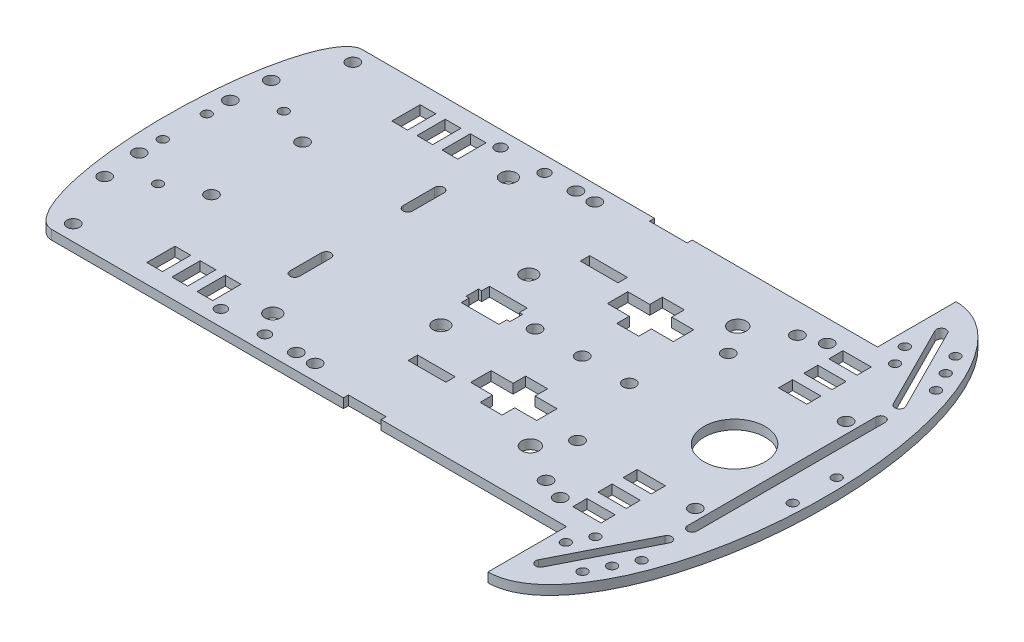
from build123d import *

# Parameters (mm, degrees)
SKETCH1_W           = 210
SKETCH1_H           = 149
BOSS_EXTRUDE1_DEPTH = 3
SKETCH2_W           = 177
SKETCH2_H           = 25
CUT_EXTRUDE1_DEPTH  = 3
SKETCH3_W           = 12
SKETCH3_H           = 3
SKETCH3_W_2         = 7
SKETCH3_H_2         = 6.5
SKETCH3_H_3         = 4
SKETCH3_R           = 2
SKETCH3_R_2         = 2.75
SKETCH3_W_3         = 9
SKETCH3_H_4         = 4.5
SKETCH3_H_5         = 1.6
SKETCH3_H_6         = 14.5
SKETCH3_W_4         = 21
CUT_EXTRUDE2_DEPTH  = 3
SKETCH4_R           = 2
SKETCH4_R_2         = 1.75
SKETCH4_R_3         = 2.5
CUT_EXTRUDE3_DEPTH  = 3
SKETCH5_W           = 5
SKETCH5_H           = 9
CUT_EXTRUDE4_DEPTH  = 3
SKETCH7_R           = 9.75
SKETCH7_R_2         = 2
SKETCH7_R_3         = 2.5
SKETCH7_W           = 12
SKETCH7_H           = 9
SKETCH7_W_2         = 14
SKETCH7_H_2         = 4
CUT_EXTRUDE5_DEPTH  = 3
SKETCH6_R           = 2
SKETCH6_R_2         = 1.5
CUT_EXTRUDE6_DEPTH  = 3
CUT_EXTRUDE7_DEPTH  = 3
SKETCH9_R           = 1.5
SKETCH9_R_2         = 2
CUT_EXTRUDE8_DEPTH  = 3
CUT_EXTRUDE9_DEPTH  = 3
CUT_EXTRUDE10_DEPTH = 3


with BuildPart() as part:
    # Sketch1 → Boss-Extrude1 (new body)
    with BuildSketch(Plane(origin=(0, 0, 0), x_dir=(1, 0, 0), z_dir=(0, 1, 0))):
        with Locations((105, 74.5)):
            Rectangle(SKETCH1_W, SKETCH1_H)
    extrude(amount=BOSS_EXTRUDE1_DEPTH)

    # Sketch2 → Cut-Extrude1 (cut)
    with BuildSketch(Plane(origin=(0, 3, 0), x_dir=(1, 0, 0), z_dir=(0, 1, 0))):
        with Locations((88.5, 136.5)):
            Rectangle(SKETCH2_W, SKETCH2_H)
        with Locations((88.5, 12.5)):
            Rectangle(SKETCH2_W, SKETCH2_H)
    extrude(amount=-CUT_EXTRUDE1_DEPTH, mode=Mode.SUBTRACT)

    # Sketch3 → Cut-Extrude2 (cut)
    with BuildSketch(Plane(origin=(0, 3, 0), x_dir=(1, 0, 0), z_dir=(0, 1, 0))):
        with Locations((112, 101.9)):
            Rectangle(SKETCH3_W, SKETCH3_H)
        with Locations((125.5, 96.25)):
            Rectangle(SKETCH3_W_2, SKETCH3_H_2)
        with Locations((132.5, 96.25)):
            Rectangle(SKETCH3_W_2, SKETCH3_H_2)
        with Locations((139.5, 96.25)):
            Rectangle(SKETCH3_W_2, SKETCH3_H_2)
        with Locations((132.5, 91)):
            Rectangle(SKETCH3_W_2, SKETCH3_H_3)
        with Locations((132.5, 101.5)):
            Rectangle(SKETCH3_W_2, SKETCH3_H_3)
        with Locations(Location((155, 98.5, 0), (0, 0, 270))):
            Circle(SKETCH3_R)
        with Locations(Location((149, 107.5, 0), (0, 0, 270))):
            Circle(SKETCH3_R_2)
        with Locations(Location((161, 114.5, 0), (0, 0, 270))):
            Circle(SKETCH3_R)
        with Locations(Location((168, 117, 0), (0, 0, 270))):
            Circle(SKETCH3_R)
        with Locations((177, 115.25)):
            Rectangle(SKETCH3_W_3, SKETCH3_H_4)
        with Locations((177, 107.25)):
            Rectangle(SKETCH3_W_3, SKETCH3_H_4)
        with Locations((177, 99.25)):
            Rectangle(SKETCH3_W_3, SKETCH3_H_4)
        with Locations((112, 47.1)):
            Rectangle(SKETCH3_W, SKETCH3_H)
        with Locations((112, 123.2)):
            Rectangle(SKETCH3_W, SKETCH3_H_5)
        with Locations((112, 25.8)):
            Rectangle(SKETCH3_W, SKETCH3_H_5)
        with Locations((132.5, 52.75)):
            Rectangle(SKETCH3_W_2, SKETCH3_H_6)
        with Locations((132.5, 52.75)):
            Rectangle(SKETCH3_W_4, SKETCH3_H_2)
        with Locations(Location((149, 41.5, 0), (0, 0, 90))):
            Circle(SKETCH3_R_2)
        with Locations(Location((155, 50.5, 0), (0, 0, 90))):
            Circle(SKETCH3_R)
        with Locations(Location((161, 34.5, 0), (0, 0, 90))):
            Circle(SKETCH3_R)
        with Locations(Location((168, 32, 0), (0, 0, 90))):
            Circle(SKETCH3_R)
        with Locations((177, 49.75)):
            Rectangle(SKETCH3_W_3, SKETCH3_H_4)
        with Locations((177, 41.75)):
            Rectangle(SKETCH3_W_3, SKETCH3_H_4)
        with Locations((177, 33.75)):
            Rectangle(SKETCH3_W_3, SKETCH3_H_4)
    extrude(amount=-CUT_EXTRUDE2_DEPTH, mode=Mode.SUBTRACT)

    # Sketch4 → Cut-Extrude3 (cut)
    with BuildSketch(Plane(origin=(0, 3, 0), x_dir=(1, 0, 0), z_dir=(0, 1, 0))):
        with Locations(Location((92, 119, 0), (0, 0, 270))):
            Circle(SKETCH4_R)
        with Locations(Location((86, 119, 0), (0, 0, 270))):
            Circle(SKETCH4_R)
        with Locations(Location((76, 119, 0), (0, 0, 270))):
            Circle(SKETCH4_R_2)
        with Locations(Location((62, 119, 0), (0, 0, 270))):
            Circle(SKETCH4_R_2)
        with Locations(Location((71.5, 112, 0), (0, 0, 270))):
            Circle(SKETCH4_R_3)
        with Locations(Location((71.5, 37, 0), (0, 0, 90))):
            Circle(SKETCH4_R_3)
        with Locations(Location((62, 30, 0), (0, 0, 90))):
            Circle(SKETCH4_R_2)
        with Locations(Location((76, 30, 0), (0, 0, 90))):
            Circle(SKETCH4_R_2)
        with Locations(Location((86, 30, 0), (0, 0, 90))):
            Circle(SKETCH4_R)
        with Locations(Location((92, 30, 0), (0, 0, 90))):
            Circle(SKETCH4_R)
        with Locations(Location((15, 119, 0), (0, 0, 270))):
            Circle(SKETCH4_R)
        with Locations(Location((15, 30, 0), (0, 0, 90))):
            Circle(SKETCH4_R)
    extrude(amount=-CUT_EXTRUDE3_DEPTH, mode=Mode.SUBTRACT)

    # Sketch5 → Cut-Extrude4 (cut)
    with BuildSketch(Plane(origin=(0, 3, 0), x_dir=(1, 0, 0), z_dir=(0, 1, 0))):
        with Locations((55.9, 113.5)):
            Rectangle(SKETCH5_W, SKETCH5_H)
        with Locations((47.9, 113.5)):
            Rectangle(SKETCH5_W, SKETCH5_H)
        with Locations((39.9, 113.5)):
            Rectangle(SKETCH5_W, SKETCH5_H)
        with Locations((39.9, 35.5)):
            Rectangle(SKETCH5_W, SKETCH5_H)
        with Locations((47.9, 35.5)):
            Rectangle(SKETCH5_W, SKETCH5_H)
        with Locations((55.9, 35.5)):
            Rectangle(SKETCH5_W, SKETCH5_H)
    extrude(amount=-CUT_EXTRUDE4_DEPTH, mode=Mode.SUBTRACT)

    # Sketch7 → Cut-Extrude5 (cut)
    with BuildSketch(Plane(origin=(0, 3, 0), x_dir=(1, 0, 0), z_dir=(0, 1, 0))):
        with Locations(Location((181, 74.5, 0), (0, 0, 270))):
            Circle(SKETCH7_R)
        with Locations(Location((132.5, 74.5, 0), (0, 0, 270))):
            Circle(SKETCH7_R_2)
        with Locations(Location((147.5, 74.5, 0), (0, 0, 270))):
            Circle(SKETCH7_R_2)
        with Locations(Location((117.5, 74.5, 0), (0, 0, 270))):
            Circle(SKETCH7_R_2)
        with Locations(Location((101.5, 88.5, 0), (0, 0, 270))):
            Circle(SKETCH7_R_3)
        with Locations(Location((101.5, 60.5, 0), (0, 0, 270))):
            Circle(SKETCH7_R_3)
        with Locations((104.5, 74.5)):
            Rectangle(SKETCH7_W, SKETCH7_H)
        with Locations((104.5, 74.5)):
            Rectangle(SKETCH7_W_2, SKETCH7_H_2)
    extrude(amount=-CUT_EXTRUDE5_DEPTH, mode=Mode.SUBTRACT)

    # Sketch6 → Cut-Extrude6 (cut)
    with BuildSketch(Plane(origin=(0, 3, 0), x_dir=(1, 0, 0), z_dir=(0, 1, 0))):
        with Locations(Location((6, 89, 0), (0, 0, 270))):
            Circle(SKETCH6_R)
        with Locations(Location((29, 89, 0), (0, 0, 270))):
            Circle(SKETCH6_R)
        with Locations(Location((29, 60, 0), (0, 0, 270))):
            Circle(SKETCH6_R)
        with Locations(Location((6, 60, 0), (0, 0, 270))):
            Circle(SKETCH6_R)
        with Locations(Location((6, 81.5, 0), (0, 0, 270))):
            Circle(SKETCH6_R_2)
        with Locations(Location((6, 67.5, 0), (0, 0, 270))):
            Circle(SKETCH6_R_2)
        with Locations(Location((7, 48, 0), (0, 0, 270))):
            Circle(SKETCH6_R)
        with Locations(Location((17.5, 54.5, 0), (0, 0, 270))):
            Circle(SKETCH6_R_2)
        with Locations(Location((17.5, 94.5, 0), (0, 0, 90))):
            Circle(SKETCH6_R_2)
        with Locations(Location((7, 101, 0), (0, 0, 90))):
            Circle(SKETCH6_R)
    extrude(amount=-CUT_EXTRUDE6_DEPTH, mode=Mode.SUBTRACT)

    # Sketch8 → Cut-Extrude7 (cut)
    with BuildSketch(Plane(origin=(0, 3, 0), x_dir=(1, 0, 0), z_dir=(0, 1, 0))):
        with BuildLine():
            Line((65.5, 97.5), (65.5, 87.5))
            ThreePointArc((65.5, 87.5), (64, 86), (62.5, 87.5))
            Line((62.5, 87.5), (62.5, 97.5))
            ThreePointArc((62.5, 97.5), (64, 99), (65.5, 97.5))
        make_face()
        with BuildLine():
            Line((65.5, 51.5), (65.5, 61.5))
            ThreePointArc((65.5, 61.5), (64, 63), (62.5, 61.5))
            Line((62.5, 61.5), (62.5, 51.5))
            ThreePointArc((62.5, 51.5), (64, 50), (65.5, 51.5))
        make_face()
    extrude(amount=-CUT_EXTRUDE7_DEPTH, mode=Mode.SUBTRACT)

    # Sketch9 → Cut-Extrude8 (cut)
    with BuildSketch(Plane(origin=(0, 3, 0), x_dir=(1, 0, 0), z_dir=(0, 1, 0))):
        with Locations(Location((195.10817133, 127.595428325, 0), (0, 0, 270))):
            Circle(SKETCH9_R)
        with Locations(Location((191.95817133, 133.846628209, 0), (0, 0, 270))):
            Circle(SKETCH9_R)
        with Locations(Location((198.25817133, 121.34422844, 0), (0, 0, 270))):
            Circle(SKETCH9_R)
        with Locations(Location((184.39182867, 122.195428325, 0), (0, 0, 270))):
            Circle(SKETCH9_R)
        with Locations(Location((181.24182867, 128.446628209, 0), (0, 0, 270))):
            Circle(SKETCH9_R)
        with Locations(Location((192.5, 98.5, 0), (0, 0, 270))):
            Circle(SKETCH9_R_2)
        with Locations(Location((206.5, 81.5, 0), (0, 0, 270))):
            Circle(SKETCH9_R)
        with Locations(Location((192.5, 50.5, 0), (0, 0, 90))):
            Circle(SKETCH9_R_2)
        with Locations(Location((184.39182867, 26.804571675, 0), (0, 0, 90))):
            Circle(SKETCH9_R)
        with Locations(Location((181.24182867, 20.553371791, 0), (0, 0, 90))):
            Circle(SKETCH9_R)
        with Locations(Location((191.95817133, 15.153371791, 0), (0, 0, 90))):
            Circle(SKETCH9_R)
        with Locations(Location((195.10817133, 21.404571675, 0), (0, 0, 90))):
            Circle(SKETCH9_R)
        with Locations(Location((198.25817133, 27.65577156, 0), (0, 0, 90))):
            Circle(SKETCH9_R)
        with Locations(Location((206.5, 67.5, 0), (0, 0, 90))):
            Circle(SKETCH9_R)
        with BuildLine():
            Line((199, 104.5), (199, 44.5))
            ThreePointArc((199, 44.5), (197.5, 43), (196, 44.5))
            Line((196, 44.5), (196, 104.5))
            ThreePointArc((196, 104.5), (197.5, 106), (199, 104.5))
        make_face()
        with BuildLine():
            Line((195.160457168, 110.825), (181.660457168, 137.615856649))
            ThreePointArc((181.660457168, 137.615856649), (182.325, 139.630399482), (184.339542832, 138.965856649))
            Line((184.339542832, 138.965856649), (197.839542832, 112.175))
            ThreePointArc((197.839542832, 112.175), (197.175, 110.160457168), (195.160457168, 110.825))
        make_face()
        with BuildLine():
            Line((195.160457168, 38.175), (181.660457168, 11.384143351))
            ThreePointArc((181.660457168, 11.384143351), (182.325, 9.369600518), (184.339542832, 10.034143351))
            Line((184.339542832, 10.034143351), (197.839542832, 36.825))
            ThreePointArc((197.839542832, 36.825), (197.175, 38.839542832), (195.160457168, 38.175))
        make_face()
    extrude(amount=-CUT_EXTRUDE8_DEPTH, mode=Mode.SUBTRACT)

    # Sketch11 → Cut-Extrude9 (cut)
    with BuildSketch(Plane(origin=(0, 3, 0), x_dir=(1, 0, 0), z_dir=(0, 1, 0))):
        with BuildLine():
            Line((210, 149), (177, 149))
            add(Edge.make_bspline(
                [(210, 74.5), (210, 149), (177, 149)],
                knots=[4.71238898, 4.71238898, 4.71238898, 6.283185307, 6.283185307, 6.283185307], degree=2, weights=[1, 0.707106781, 1]))
            Line((210, 74.5), (210, 149))
        make_face()
        with BuildLine():
            add(Edge.make_bspline(
                [(177, 0), (210, 0), (210, 74.5)],
                knots=[3.141592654, 3.141592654, 3.141592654, 4.71238898, 4.71238898, 4.71238898], degree=2, weights=[1, 0.707106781, 1]))
            Line((177, 0), (210, 0))
            Line((210, 0), (210, 74.5))
        make_face()
    extrude(amount=-CUT_EXTRUDE9_DEPTH, mode=Mode.SUBTRACT)

    # Sketch12 → Cut-Extrude10 (cut)
    with BuildSketch(Plane(origin=(0, 3, 0), x_dir=(1, 0, 0), z_dir=(0, 1, 0))):
        with BuildLine():
            add(Edge.make_bspline(
                [(13, 124), (0, 124), (0, 74.5)],
                knots=[0, 0, 0, 1.570796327, 1.570796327, 1.570796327], degree=2, weights=[1, 0.707106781, 1]))
            Line((13, 124), (0, 124))
            Line((0, 124), (0, 74.5))
        make_face()
        with BuildLine():
            add(Edge.make_bspline(
                [(0, 74.5), (0, 25), (13, 25)],
                knots=[1.570796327, 1.570796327, 1.570796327, 3.141592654, 3.141592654, 3.141592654], degree=2, weights=[1, 0.707106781, 1]))
            Line((0, 74.5), (0, 25))
            Line((0, 25), (13, 25))
        make_face()
    extrude(amount=-CUT_EXTRUDE10_DEPTH, mode=Mode.SUBTRACT)


solid = part.part
